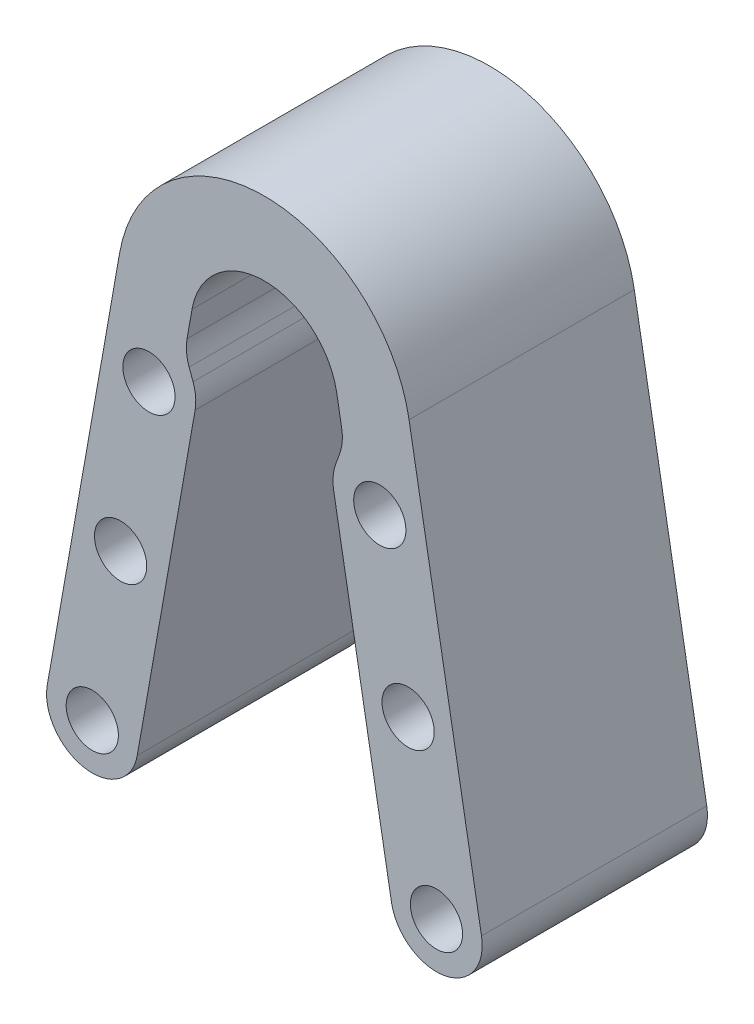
from build123d import *

# Parameters (mm, degrees)
SKETCH_1_R      = 1.6
EXTRUDE_1_DEPTH = 6.9
FILLET_1_R      = 2.8


with BuildPart() as part:
    # Sketch 1 → Extrude 1 (new, symmetric)
    with BuildSketch(Plane.XY):
        with BuildLine():
            Line((4.431634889, 0.7814168), (4.865755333, -1.680602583))
            Line((4.865755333, -1.680602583), (4.113311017, -3.747926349))
            Line((4.113311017, -3.747926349), (7.786014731, -24.576864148))
            ThreePointArc((7.786014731, -24.576864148), (11.029691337, -26.848110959), (13.300938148, -23.604434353))
            Line((13.300938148, -23.604434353), (8.863269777, 1.562833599))
            ThreePointArc((8.863269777, 1.562833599), (0, 9), (-8.863269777, 1.562833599))
            Line((-8.863269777, 1.562833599), (-13.300938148, -23.604434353))
            ThreePointArc((-13.300938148, -23.604434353), (-11.029691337, -26.848110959), (-7.786014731, -24.576864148))
            Line((-7.786014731, -24.576864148), (-4.113311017, -3.747926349))
            Line((-4.113311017, -3.747926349), (-4.865755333, -1.680602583))
            Line((-4.865755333, -1.680602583), (-4.431634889, 0.7814168))
            ThreePointArc((-4.431634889, 0.7814168), (0, 4.5), (4.431634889, 0.7814168))
        make_face()
        with Locations(Location((10.543476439, -24.090649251, 0), (0, 0, 180))):
            Circle(SKETCH_1_R, mode=Mode.SUBTRACT)
        with Locations(Location((8.806994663, -14.242571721, 0), (0, 0, 180))):
            Circle(SKETCH_1_R, mode=Mode.SUBTRACT)
        with Locations(Location((7.070512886, -4.39449419, 0), (0, 0, 180))):
            Circle(SKETCH_1_R, mode=Mode.SUBTRACT)
        with Locations(Location((-7.070512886, -4.39449419, 0), (0, 0, 180))):
            Circle(SKETCH_1_R, mode=Mode.SUBTRACT)
        with Locations(Location((-8.806994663, -14.242571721, 0), (0, 0, 180))):
            Circle(SKETCH_1_R, mode=Mode.SUBTRACT)
        with Locations(Location((-10.543476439, -24.090649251, 0), (0, 0, 180))):
            Circle(SKETCH_1_R, mode=Mode.SUBTRACT)
    extrude(amount=EXTRUDE_1_DEPTH, both=True)

    # Fillet 1
    fillet_1_edges = [part.edges().sort_by_distance(p)[0] for p in [
        (-4.865755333, -1.680602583, 0),
        (-4.113311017, -3.747926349, 0),
        (4.113311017, -3.747926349, 0),
        (4.865755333, -1.680602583, 0),
    ]]
    fillet(fillet_1_edges, radius=FILLET_1_R)


solid = part.part
